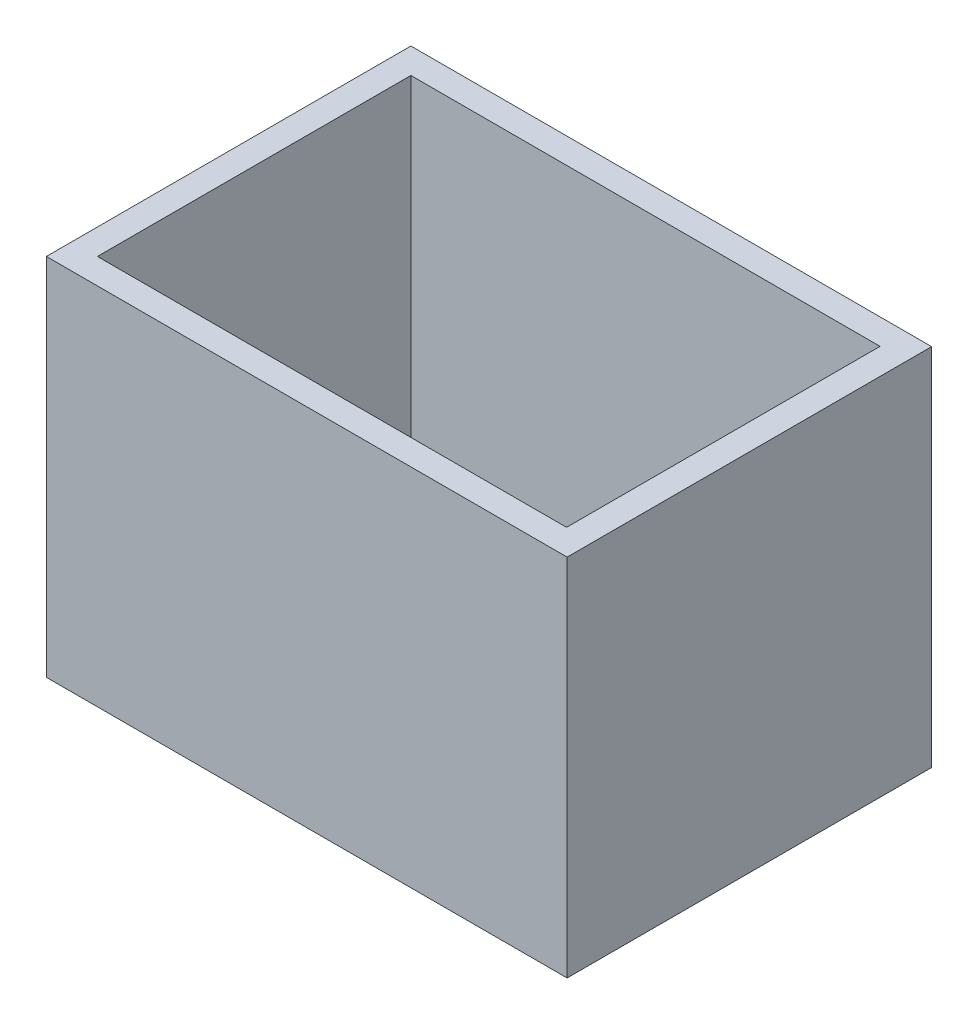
from build123d import *

# Parameters (mm, degrees)
SKETCH1_W           = 127
SKETCH1_H           = 88.9
BOSS_EXTRUDE1_DEPTH = 88.9
SKETCH2_W           = 114.427
SKETCH2_H           = 76.454
CUT_EXTRUDE1_DEPTH  = 130.126071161


with BuildPart() as part:
    # Sketch1 → Boss-Extrude1 (new body)
    with BuildSketch(Plane(origin=(0, 0, 0), x_dir=(1, 0, 0), z_dir=(0, 1, 0))):
        with Locations((-12.796211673, -9.85672461)):
            Rectangle(SKETCH1_W, SKETCH1_H)
    extrude(amount=BOSS_EXTRUDE1_DEPTH)

    # Sketch2 → Cut-Extrude1 (cut, through all)
    with BuildSketch(Plane(origin=(0, 88.9, 0), x_dir=(1, 0, 0), z_dir=(0, 1, 0))):
        with Locations((-12.859711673, -9.85672461)):
            Rectangle(SKETCH2_W, SKETCH2_H)
    extrude(amount=-CUT_EXTRUDE1_DEPTH, mode=Mode.SUBTRACT)


solid = part.part
